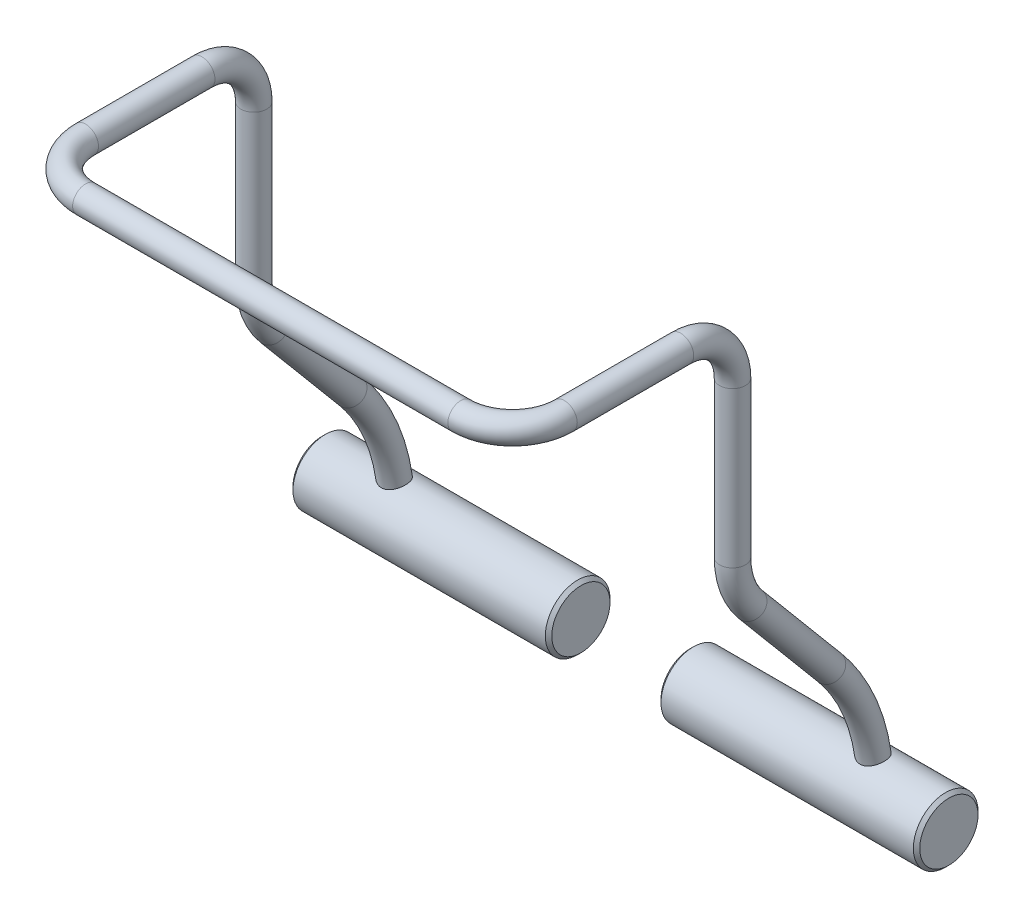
from build123d import *

# Parameters (mm, degrees)
ESQUISSE3_R        = 1
BOSS_EXTRU_2_START = -14.28
ESQUISSE4_R        = 2.5
BOSS_EXTRU_2_DEPTH = 20
CHANFREIN1_SIZE    = 0.25


with BuildPart() as part:
    # Base-Balayage: sweep along a curve in space
    with BuildLine() as base_balayage_path:
        Line((0, 0, 0), (0, 0.247335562, 0))
        ThreePointArc((0, 0.247335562, 0), (0, 5.377637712, 0.904610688), (0, 9.889149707, 3.509333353))
        Line((0, 9.889149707, 3.509333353), (0, 17.143274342, 9.596266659))
        ThreePointArc((0, 17.143274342, 9.596266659), (0, 18.94787914, 10.638155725), (0, 21, 11))
        Line((0, 21, 11), (0, 33, 11))
        ThreePointArc((0, 33, 11), (0, 35.828427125, 12.171572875), (0, 37, 15))
        Line((0, 37, 15), (0, 37, 24))
        ThreePointArc((0, 37, 24), (-1.171572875, 37, 26.828427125), (-4, 37, 28))
        Line((-4, 37, 28), (-18.5, 37, 28))
    # Esquisse3 → Base-Balayage (sweep)
    with BuildSketch(Plane(origin=(0, 0, 0), x_dir=(1, 0, 0), z_dir=(0, 1, 0))):
        Circle(ESQUISSE3_R)
    base_balayage = sweep(path=base_balayage_path.line)

    # Esquisse4 → Boss.-Extru.2 (add)
    with BuildSketch(Plane(origin=(0, 0, 0), x_dir=(0, 0, -1), z_dir=(1, 0, 0)).offset(BOSS_EXTRU_2_START)):
        Circle(ESQUISSE4_R)
    boss_extru_2 = extrude(amount=BOSS_EXTRU_2_DEPTH)

    # Sym_trie1: Base-Balayage, Boss.-Extru.2 across plane
    add(base_balayage.mirror(Plane(origin=(-18.5, 37, 28), x_dir=(0, 0, 1), z_dir=(-1, 0, 0))))
    add(boss_extru_2.mirror(Plane(origin=(-18.5, 37, 28), x_dir=(0, 0, 1), z_dir=(-1, 0, 0))))

    # Chanfrein1
    chanfrein1_edges = [part.edges().sort_by_distance(p)[0] for p in [
        (-14.28, 0, 2.5),
        (5.72, 0, 2.5),
        (-42.72, 0, 2.5),
        (-22.72, 0, 2.5),
    ]]
    chamfer(chanfrein1_edges, length=CHANFREIN1_SIZE)


solid = part.part
